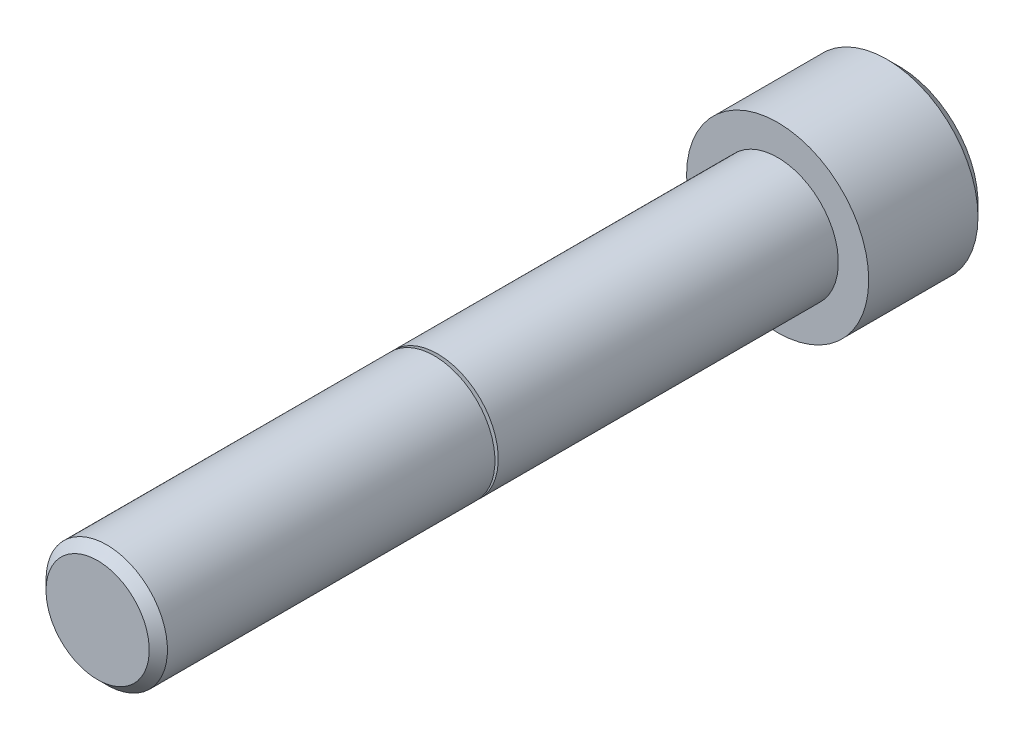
from build123d import *

# Parameters (mm, degrees)
CUT_EXTRUDE1_DEPTH = 7.9375


with BuildPart() as part:
    # Logo3_bib1 → Revolve1 (revolve)
    with BuildSketch(Plane(origin=(0, 0, 0), x_dir=(-1, 0, 0), z_dir=(0, -1, 0))):
        with BuildLine():
            Line((0, -88.9), (0, 15.875))
            Line((0, 15.875), (10.31875, 15.875))
            Line((10.31875, 15.875), (11.90625, 14.2875))
            Line((11.90625, 14.2875), (11.90625, 0))
            Line((11.90625, 0), (7.9375, 0))
            Line((7.9375, 0), (7.9375, -44.46))
            Line((7.9375, -44.46), (6.860935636, -44.46))
            ThreePointArc((6.860935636, -44.46), (6.841239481, -44.476527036), (6.854095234, -44.498793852))
            Line((6.854095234, -44.498793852), (7.9375, -44.893120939))
            Line((7.9375, -44.893120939), (7.9375, -87.71001))
            Line((7.9375, -87.71001), (6.74751, -88.9))
            Line((6.74751, -88.9), (0, -88.9))
        make_face()
    revolve(axis=Axis((0, 0, -10.585154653), (0, 0, 1)))

    # Logo3_bib2 → Cut-Extrude1 (cut)
    with BuildSketch(Plane(origin=(0, 0, -15.875), x_dir=(1, 0, 0), z_dir=(0, 0, -1))):
        Polygon((7.332348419, 0), (3.666174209, 6.35), (-3.666174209, 6.35), (-7.332348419, 0), (-3.666174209, -6.35), (3.666174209, -6.35), align=None)
    extrude(amount=-CUT_EXTRUDE1_DEPTH, mode=Mode.SUBTRACT)


solid = part.part
